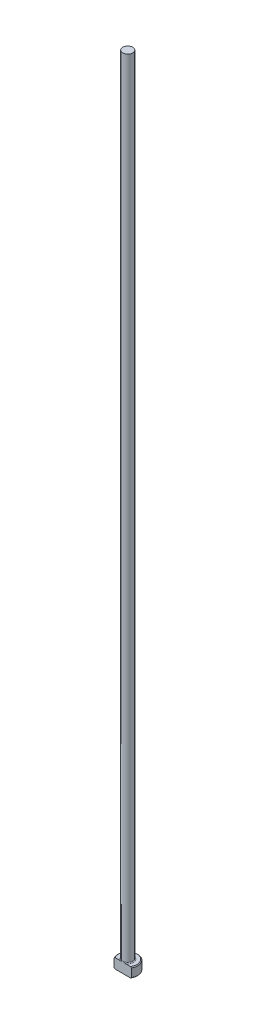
from build123d import *

# Parameters (mm, degrees)
CHAMFER1_SIZE = 0.254
FILLET1_R     = 0.254
KEY_DEPTH     = 255.0396844


with BuildPart() as part:
    # Sketch1 → Revolve1 (revolve)
    with BuildSketch(Plane.XY, mode=Mode.PRIVATE) as revolve1_sk:
        Polygon((0, 0), (-3.175, 0), (-3.175, 3.175), (-1.5875, 3.175), (-1.5875, 254), (0, 254), align=None)
    revolve(revolve1_sk.sketch.rotate(Axis((0, 259.958771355, 0), (0, -1, 0)), 270), axis=Axis((0, 259.958771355, 0), (0, -1, 0)))

    # Chamfer1
    chamfer1_edges = [part.edges().sort_by_distance(p)[0] for p in [
        (0, 3.175, -3.175),
        (0, 0, -3.175),
    ]]
    chamfer(chamfer1_edges, length=CHAMFER1_SIZE)

    # Fillet1
    fillet1_edges = [part.edges().sort_by_distance(p)[0] for p in [
        (0, 3.175, -1.5875),
    ]]
    fillet(fillet1_edges, radius=FILLET1_R)

    # Sketch2 → KEY (cut, through all)
    with BuildSketch(Plane.XZ):
        with BuildLine():
            Line((-2.749630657, 1.5875), (2.749630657, 1.5875))
            ThreePointArc((2.749630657, 1.5875), (0, 3.175), (-2.749630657, 1.5875))
        make_face()
    extrude(amount=-KEY_DEPTH, mode=Mode.SUBTRACT)


solid = part.part
